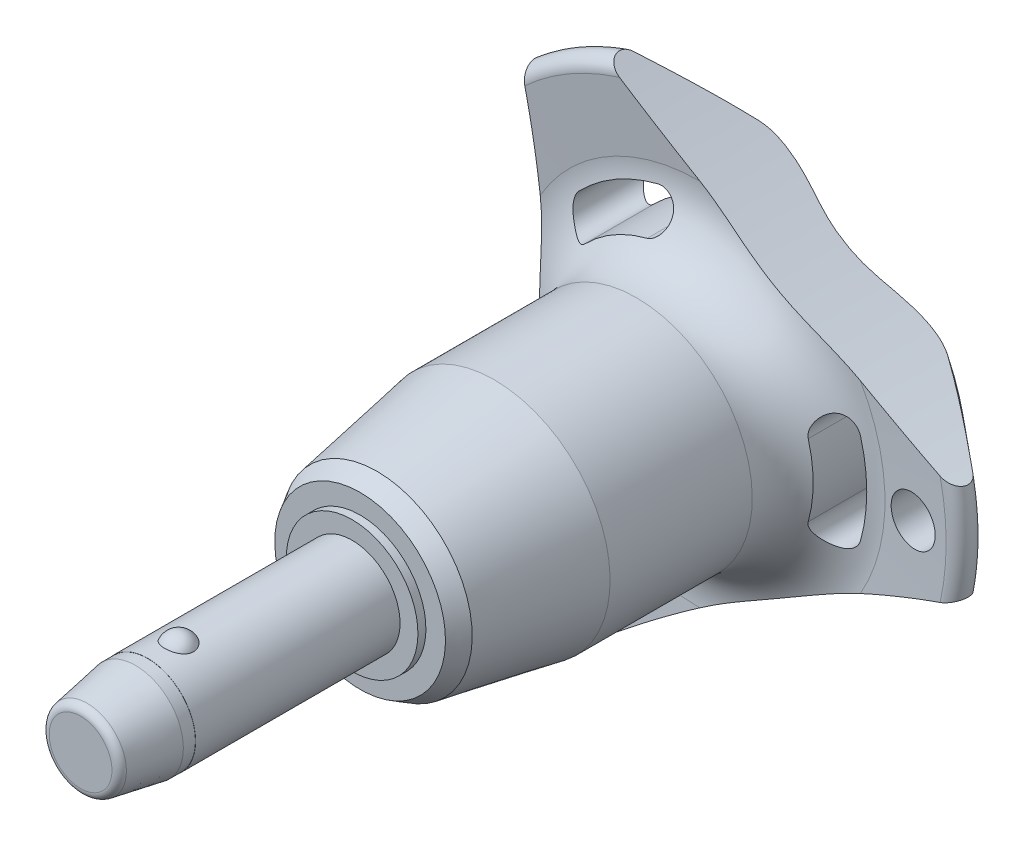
from build123d import *

# Parameters (mm, degrees)
SKETCH1_R           = 3
BOSS_EXTRUDE1_DEPTH = 10
SKETCH2_R           = 2.5
BOSS_EXTRUDE2_DEPTH = 26.7
BOSS_EXTRUDE3_START = 7
SKETCH1_2_R         = 3
BOSS_EXTRUDE3_DEPTH = 7
CHAMFER1_SIZE       = 3.5
CHAMFER1_SIZE2      = 0.617144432
FILLET1_R           = 0.5
SKETCH6_R           = 79.96
CUT_EXTRUDE1_DEPTH  = 44.566782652
CIRPATTERN1_COUNT   = 3
SKETCH7_R           = 1.5
CUT_EXTRUDE2_DEPTH  = 44.216000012
SKETCH8_R           = 3
SKETCH8_R_2         = 2.99
CUT_EXTRUDE3_DEPTH  = 4.2


with BuildPart() as part:
    # Sketch1 → Boss-Extrude1 (new body)
    with BuildSketch(Plane.XY):
        Circle(SKETCH1_R)
    extrude(amount=-BOSS_EXTRUDE1_DEPTH)

    # Sketch2 → Boss-Extrude2 (add)
    with BuildSketch(Plane(origin=(0, 0, -10), x_dir=(-1, 0, 0), z_dir=(0, 0, -1))):
        Circle(SKETCH2_R)
    extrude(amount=BOSS_EXTRUDE2_DEPTH)

    # Sketch3 → Revolve1 (revolve)
    with BuildSketch(Plane(origin=(0, 0, 0), x_dir=(0, 0, -1), z_dir=(1, 0, 0))):
        with BuildLine():
            Line((-0.866025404, 3.5), (-0.866025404, 1.5))
            ThreePointArc((-0.866025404, 1.5), (0.133974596, 2.5), (-0.866025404, 3.5))
        make_face()
        with BuildLine():
            Line((-0.866025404, -1.5), (-0.866025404, -3.5))
            ThreePointArc((-0.866025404, -3.5), (0.133974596, -2.5), (-0.866025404, -1.5))
        make_face()
    revolve(axis=Axis((0, -1.5, 0.866025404), (0, 1, 0)))

    # Sketch1_2 → Boss-Extrude3 (add)
    with BuildSketch(Plane.XY.offset(BOSS_EXTRUDE3_START)):
        Circle(SKETCH1_2_R)
    extrude(amount=-BOSS_EXTRUDE3_DEPTH)

    # Chamfer1
    chamfer1_edges = [part.edges().sort_by_distance(p)[0] for p in [
        (-3, 0, 7),
    ]]
    chamfer1_side = [part.faces().sort_by_distance(p)[0] for p in [
        (-3, 0, -1.5),
    ]]
    chamfer(chamfer1_edges, length=CHAMFER1_SIZE, length2=CHAMFER1_SIZE2, reference=chamfer1_side[0])

    # Fillet1
    fillet1_edges = [part.edges().sort_by_distance(p)[0] for p in [
        (-2.382855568, 0, 7),
        (2.5, 0, -36.7),
    ]]
    fillet(fillet1_edges, radius=FILLET1_R)

    # Sketch4 → Revolve2 (revolve)
    with BuildSketch(Plane(origin=(0, 0, 0), x_dir=(0, 0, -1), z_dir=(1, 0, 0))):
        Polygon((10, 0), (10, 4.118359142), (10.5, 4.118359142), (10.5, 5.343400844), (11.560917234, 5.955921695), (18.9, 7.25), (27.8, 7.25), (27.8, 0), align=None)
    revolve(axis=Axis((0, 0, -27.8), (0, 0, 1)))

    # Sketch5 → Revolve3 (revolve)
    with BuildSketch(Plane(origin=(0, 0, 0), x_dir=(0, 0, -1), z_dir=(1, 0, 0)), mode=Mode.PRIVATE) as revolve3_sk:
        with BuildLine():
            Line((31.78715932, 11.570250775), (31.452568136, 15.735949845))
            ThreePointArc((31.452568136, 15.735949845), (31.946485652, 16.540188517), (32.862835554, 16.314230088))
            Line((32.862835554, 16.314230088), (36.326414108, 12.186497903))
            ThreePointArc((36.326414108, 12.186497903), (36.7, 11.109282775), (36.261488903, 10.056825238))
            ThreePointArc((36.261488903, 10.056825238), (33.289873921, 5.413681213), (32.25, 0))
            Line((32.25, 0), (27.8, 0))
            Line((27.8, 0), (27.8, 7.25))
            ThreePointArc((27.8, 7.25), (30.739473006, 8.537160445), (31.78715932, 11.570250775))
        make_face()
    revolve(revolve3_sk.sketch.rotate(Axis((0, 0, -32.25), (0, 0, 1)), 90), axis=Axis((0, 0, -32.25), (0, 0, 1)))

    # Sketch6 → Cut-Extrude1 (cut, through all)
    with BuildSketch(Plane.XY):
        with Locations((-89.76, 0)):
            Circle(SKETCH6_R)
        with BuildLine():
            ThreePointArc((10.099921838, -2.834717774), (10.490188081, 0), (10.099921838, 2.834717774))
            ThreePointArc((10.099921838, 2.834717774), (8.768180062, 3.582738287), (8.020159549, 2.250996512))
            ThreePointArc((8.020159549, 2.250996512), (8.330062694, 0), (8.020159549, -2.250996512))
            ThreePointArc((8.020159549, -2.250996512), (8.768180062, -3.582738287), (10.099921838, -2.834717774))
        make_face()
    cut_extrude1 = extrude(amount=-CUT_EXTRUDE1_DEPTH, mode=Mode.SUBTRACT)

    # CirPattern1: Cut-Extrude1 ×3 about axis
    cirpattern1_axis = Axis((0, 0, 0), (0, 0, 1))
    for i in range(1, CIRPATTERN1_COUNT):
        add(cut_extrude1.rotate(cirpattern1_axis, i * 360 / CIRPATTERN1_COUNT), mode=Mode.SUBTRACT)

    # Sketch7 → Cut-Extrude2 (cut, through all)
    with BuildSketch(Plane.XY):
        with Locations(Location((13.490188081, 0, 0), (0, 0, 225.221865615))):
            Circle(SKETCH7_R)
    extrude(amount=-CUT_EXTRUDE2_DEPTH, mode=Mode.SUBTRACT)

    # Sketch8 → Cut-Extrude3 (cut)
    with BuildSketch(Plane.XY.offset(7)):
        Circle(SKETCH8_R)
        Circle(SKETCH8_R_2, mode=Mode.SUBTRACT)
    extrude(amount=-CUT_EXTRUDE3_DEPTH, mode=Mode.SUBTRACT)


solid = part.part
